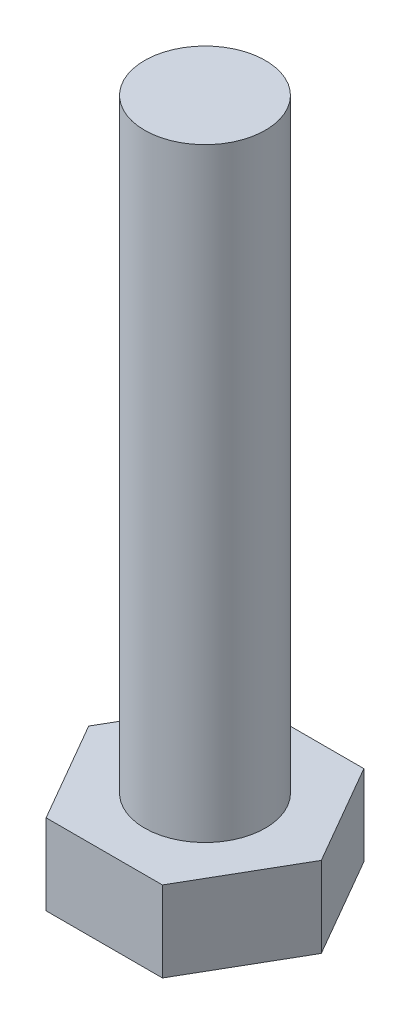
ISO-10303-21;
HEADER;
FILE_DESCRIPTION(('STEP AP214'),'2;1');
FILE_NAME('part.step','',(''),(''),'','','');
FILE_SCHEMA(('AUTOMOTIVE_DESIGN { 1 0 10303 214 1 1 1 1 }'));
ENDSEC;
DATA;
#1=APPLICATION_CONTEXT('core data for automotive mechanical design processes');
#2=APPLICATION_PROTOCOL_DEFINITION('international standard','automotive_design',2000,#1);
#3=PRODUCT_CONTEXT('',#1,'mechanical');
#4=PRODUCT('Part','Part','',(#3));
#5=PRODUCT_RELATED_PRODUCT_CATEGORY('part','',(#4));
#6=PRODUCT_DEFINITION_FORMATION('','',#4);
#7=PRODUCT_DEFINITION_CONTEXT('part definition',#1,'design');
#8=PRODUCT_DEFINITION('design','',#6,#7);
#9=PRODUCT_DEFINITION_SHAPE('','',#8);
#10=(LENGTH_UNIT() NAMED_UNIT(*) SI_UNIT(.MILLI.,.METRE.));
#11=(NAMED_UNIT(*) PLANE_ANGLE_UNIT() SI_UNIT($,.RADIAN.));
#12=(NAMED_UNIT(*) SI_UNIT($,.STERADIAN.) SOLID_ANGLE_UNIT());
#13=UNCERTAINTY_MEASURE_WITH_UNIT(LENGTH_MEASURE(1.E-05),#10,'distance_accuracy_value','');
#14=(GEOMETRIC_REPRESENTATION_CONTEXT(3) GLOBAL_UNCERTAINTY_ASSIGNED_CONTEXT((#13)) GLOBAL_UNIT_ASSIGNED_CONTEXT((#10,
#11,#12)) REPRESENTATION_CONTEXT('',''));
#15=CARTESIAN_POINT('',(0.,0.,0.));
#16=DIRECTION('',(0.,0.,1.));
#17=DIRECTION('',(1.,0.,0.));
#18=AXIS2_PLACEMENT_3D('',#15,#16,#17);
#19=CARTESIAN_POINT('',(5.77350269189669,4.,-1.11022302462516E-13));
#20=DIRECTION('',(0.,1.,0.));
#21=DIRECTION('',(0.,0.,1.));
#22=AXIS2_PLACEMENT_3D('',#19,#20,#21);
#23=PLANE('',#22);
#24=DIRECTION('',(0.5,0.,-0.866025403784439));
#25=VECTOR('',#24,1.);
#26=CARTESIAN_POINT('',(2.88675134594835,4.,5.00000000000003));
#27=LINE('',#26,#25);
#28=CARTESIAN_POINT('',(2.88675134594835,4.,5.00000000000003));
#29=VERTEX_POINT('',#28);
#30=CARTESIAN_POINT('',(5.77350269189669,4.,-1.11022302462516E-13));
#31=VERTEX_POINT('',#30);
#32=EDGE_CURVE('E134',#29,#31,#27,.T.);
#33=ORIENTED_EDGE('',*,*,#32,.T.);
#34=DIRECTION('',(-0.500000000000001,0.,-0.866025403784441));
#35=VECTOR('',#34,1.);
#36=CARTESIAN_POINT('',(5.77350269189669,4.,-1.11022302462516E-13));
#37=LINE('',#36,#35);
#38=CARTESIAN_POINT('',(2.88675134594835,4.,-5.));
#39=VERTEX_POINT('',#38);
#40=EDGE_CURVE('E108',#31,#39,#37,.T.);
#41=ORIENTED_EDGE('',*,*,#40,.T.);
#42=DIRECTION('',(-1.,0.,0.));
#43=VECTOR('',#42,1.);
#44=CARTESIAN_POINT('',(2.88675134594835,4.,-5.));
#45=LINE('',#44,#43);
#46=CARTESIAN_POINT('',(-2.8867513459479,4.,-5.00000000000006));
#47=VERTEX_POINT('',#46);
#48=EDGE_CURVE('E139',#39,#47,#45,.T.);
#49=ORIENTED_EDGE('',*,*,#48,.T.);
#50=DIRECTION('',(-0.5,0.,0.866025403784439));
#51=VECTOR('',#50,1.);
#52=CARTESIAN_POINT('',(-2.8867513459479,4.,-5.00000000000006));
#53=LINE('',#52,#51);
#54=CARTESIAN_POINT('',(-5.77350269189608,4.,0.));
#55=VERTEX_POINT('',#54);
#56=EDGE_CURVE('E142',#47,#55,#53,.T.);
#57=ORIENTED_EDGE('',*,*,#56,.T.);
#58=DIRECTION('',(0.500000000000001,0.,0.866025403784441));
#59=VECTOR('',#58,1.);
#60=CARTESIAN_POINT('',(-5.77350269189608,4.,0.));
#61=LINE('',#60,#59);
#62=CARTESIAN_POINT('',(-2.88675134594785,4.,4.99999999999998));
#63=VERTEX_POINT('',#62);
#64=EDGE_CURVE('E61',#55,#63,#61,.T.);
#65=ORIENTED_EDGE('',*,*,#64,.T.);
#66=DIRECTION('',(1.,0.,0.));
#67=VECTOR('',#66,1.);
#68=CARTESIAN_POINT('',(-2.88675134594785,4.,4.99999999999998));
#69=LINE('',#68,#67);
#70=EDGE_CURVE('E56',#63,#29,#69,.T.);
#71=ORIENTED_EDGE('',*,*,#70,.T.);
#72=EDGE_LOOP('',(#33,#41,#49,#57,#65,#71));
#73=FACE_BOUND('',#72,.T.);
#74=CARTESIAN_POINT('',(1.66533453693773E-13,4.,0.));
#75=DIRECTION('',(0.,1.,0.));
#76=DIRECTION('',(0.,0.,1.));
#77=AXIS2_PLACEMENT_3D('',#74,#75,#76);
#78=CIRCLE('',#77,3.);
#79=CARTESIAN_POINT('',(1.66533453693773E-13,4.,2.99999999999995));
#80=VERTEX_POINT('',#79);
#81=EDGE_CURVE('E120',#80,#80,#78,.T.);
#82=ORIENTED_EDGE('',*,*,#81,.F.);
#83=EDGE_LOOP('',(#82));
#84=FACE_BOUND('',#83,.T.);
#85=ADVANCED_FACE('F40',(#73,#84),#23,.T.);
#86=CARTESIAN_POINT('',(2.88675134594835,4.,5.00000000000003));
#87=DIRECTION('',(-0.866025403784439,0.,-0.5));
#88=DIRECTION('',(-0.5,0.,0.866025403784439));
#89=AXIS2_PLACEMENT_3D('',#86,#87,#88);
#90=PLANE('',#89);
#91=DIRECTION('',(0.5,0.,-0.866025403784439));
#92=VECTOR('',#91,1.);
#93=CARTESIAN_POINT('',(2.88675134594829,0.,5.00000000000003));
#94=LINE('',#93,#92);
#95=CARTESIAN_POINT('',(2.88675134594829,0.,5.00000000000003));
#96=VERTEX_POINT('',#95);
#97=CARTESIAN_POINT('',(5.77350269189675,0.,0.));
#98=VERTEX_POINT('',#97);
#99=EDGE_CURVE('E98',#96,#98,#94,.T.);
#100=ORIENTED_EDGE('',*,*,#99,.T.);
#101=DIRECTION('',(0.,-1.,0.));
#102=VECTOR('',#101,1.);
#103=CARTESIAN_POINT('',(5.77350269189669,4.,-1.11022302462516E-13));
#104=LINE('',#103,#102);
#105=EDGE_CURVE('E11',#31,#98,#104,.T.);
#106=ORIENTED_EDGE('',*,*,#105,.F.);
#107=ORIENTED_EDGE('',*,*,#32,.F.);
#108=DIRECTION('',(0.,-1.,0.));
#109=VECTOR('',#108,1.);
#110=CARTESIAN_POINT('',(2.88675134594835,4.,5.00000000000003));
#111=LINE('',#110,#109);
#112=EDGE_CURVE('E112',#29,#96,#111,.T.);
#113=ORIENTED_EDGE('',*,*,#112,.T.);
#114=EDGE_LOOP('',(#100,#106,#107,#113));
#115=FACE_BOUND('',#114,.T.);
#116=ADVANCED_FACE('F42',(#115),#90,.F.);
#117=CARTESIAN_POINT('',(5.77350269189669,4.,-1.11022302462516E-13));
#118=DIRECTION('',(-0.866025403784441,0.,0.500000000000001));
#119=DIRECTION('',(0.500000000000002,0.,0.866025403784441));
#120=AXIS2_PLACEMENT_3D('',#117,#118,#119);
#121=PLANE('',#120);
#122=DIRECTION('',(-0.500000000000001,0.,-0.866025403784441));
#123=VECTOR('',#122,1.);
#124=CARTESIAN_POINT('',(5.77350269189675,0.,0.));
#125=LINE('',#124,#123);
#126=CARTESIAN_POINT('',(2.88675134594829,0.,-5.));
#127=VERTEX_POINT('',#126);
#128=EDGE_CURVE('E94',#98,#127,#125,.T.);
#129=ORIENTED_EDGE('',*,*,#128,.T.);
#130=DIRECTION('',(0.,-1.,0.));
#131=VECTOR('',#130,1.);
#132=CARTESIAN_POINT('',(2.88675134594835,4.,-5.));
#133=LINE('',#132,#131);
#134=EDGE_CURVE('E49',#39,#127,#133,.T.);
#135=ORIENTED_EDGE('',*,*,#134,.F.);
#136=ORIENTED_EDGE('',*,*,#40,.F.);
#137=ORIENTED_EDGE('',*,*,#105,.T.);
#138=EDGE_LOOP('',(#129,#135,#136,#137));
#139=FACE_BOUND('',#138,.T.);
#140=ADVANCED_FACE('F107',(#139),#121,.F.);
#141=CARTESIAN_POINT('',(2.88675134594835,4.,-5.));
#142=DIRECTION('',(0.,0.,1.));
#143=DIRECTION('',(1.,0.,0.));
#144=AXIS2_PLACEMENT_3D('',#141,#142,#143);
#145=PLANE('',#144);
#146=DIRECTION('',(-1.,0.,0.));
#147=VECTOR('',#146,1.);
#148=CARTESIAN_POINT('',(2.88675134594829,0.,-5.));
#149=LINE('',#148,#147);
#150=CARTESIAN_POINT('',(-2.8867513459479,0.,-5.00000000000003));
#151=VERTEX_POINT('',#150);
#152=EDGE_CURVE('E100',#127,#151,#149,.T.);
#153=ORIENTED_EDGE('',*,*,#152,.T.);
#154=DIRECTION('',(0.,-1.,0.));
#155=VECTOR('',#154,1.);
#156=CARTESIAN_POINT('',(-2.8867513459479,4.,-5.00000000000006));
#157=LINE('',#156,#155);
#158=EDGE_CURVE('E159',#47,#151,#157,.T.);
#159=ORIENTED_EDGE('',*,*,#158,.F.);
#160=ORIENTED_EDGE('',*,*,#48,.F.);
#161=ORIENTED_EDGE('',*,*,#134,.T.);
#162=EDGE_LOOP('',(#153,#159,#160,#161));
#163=FACE_BOUND('',#162,.T.);
#164=ADVANCED_FACE('F164',(#163),#145,.F.);
#165=CARTESIAN_POINT('',(-2.8867513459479,4.,-5.00000000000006));
#166=DIRECTION('',(0.86602540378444,0.,0.500000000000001));
#167=DIRECTION('',(0.500000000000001,0.,-0.86602540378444));
#168=AXIS2_PLACEMENT_3D('',#165,#166,#167);
#169=PLANE('',#168);
#170=DIRECTION('',(-0.5,0.,0.866025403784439));
#171=VECTOR('',#170,1.);
#172=CARTESIAN_POINT('',(-2.8867513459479,0.,-5.00000000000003));
#173=LINE('',#172,#171);
#174=CARTESIAN_POINT('',(-5.77350269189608,0.,0.));
#175=VERTEX_POINT('',#174);
#176=EDGE_CURVE('E126',#151,#175,#173,.T.);
#177=ORIENTED_EDGE('',*,*,#176,.T.);
#178=DIRECTION('',(0.,-1.,0.));
#179=VECTOR('',#178,1.);
#180=CARTESIAN_POINT('',(-5.77350269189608,4.,0.));
#181=LINE('',#180,#179);
#182=EDGE_CURVE('E155',#55,#175,#181,.T.);
#183=ORIENTED_EDGE('',*,*,#182,.F.);
#184=ORIENTED_EDGE('',*,*,#56,.F.);
#185=ORIENTED_EDGE('',*,*,#158,.T.);
#186=EDGE_LOOP('',(#177,#183,#184,#185));
#187=FACE_BOUND('',#186,.T.);
#188=ADVANCED_FACE('F170',(#187),#169,.F.);
#189=CARTESIAN_POINT('',(-5.77350269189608,4.,0.));
#190=DIRECTION('',(0.866025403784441,0.,-0.500000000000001));
#191=DIRECTION('',(-0.500000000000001,0.,-0.866025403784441));
#192=AXIS2_PLACEMENT_3D('',#189,#190,#191);
#193=PLANE('',#192);
#194=DIRECTION('',(0.500000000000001,0.,0.866025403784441));
#195=VECTOR('',#194,1.);
#196=CARTESIAN_POINT('',(-5.77350269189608,0.,0.));
#197=LINE('',#196,#195);
#198=CARTESIAN_POINT('',(-2.88675134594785,0.,4.99999999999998));
#199=VERTEX_POINT('',#198);
#200=EDGE_CURVE('E129',#175,#199,#197,.T.);
#201=ORIENTED_EDGE('',*,*,#200,.T.);
#202=DIRECTION('',(0.,-1.,0.));
#203=VECTOR('',#202,1.);
#204=CARTESIAN_POINT('',(-2.88675134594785,4.,4.99999999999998));
#205=LINE('',#204,#203);
#206=EDGE_CURVE('E151',#63,#199,#205,.T.);
#207=ORIENTED_EDGE('',*,*,#206,.F.);
#208=ORIENTED_EDGE('',*,*,#64,.F.);
#209=ORIENTED_EDGE('',*,*,#182,.T.);
#210=EDGE_LOOP('',(#201,#207,#208,#209));
#211=FACE_BOUND('',#210,.T.);
#212=ADVANCED_FACE('F173',(#211),#193,.F.);
#213=CARTESIAN_POINT('',(-2.88675134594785,4.,4.99999999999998));
#214=DIRECTION('',(0.,0.,-1.));
#215=DIRECTION('',(-1.,0.,0.));
#216=AXIS2_PLACEMENT_3D('',#213,#214,#215);
#217=PLANE('',#216);
#218=DIRECTION('',(1.,0.,0.));
#219=VECTOR('',#218,1.);
#220=CARTESIAN_POINT('',(-2.88675134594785,0.,4.99999999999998));
#221=LINE('',#220,#219);
#222=EDGE_CURVE('E131',#199,#96,#221,.T.);
#223=ORIENTED_EDGE('',*,*,#222,.T.);
#224=ORIENTED_EDGE('',*,*,#112,.F.);
#225=ORIENTED_EDGE('',*,*,#70,.F.);
#226=ORIENTED_EDGE('',*,*,#206,.T.);
#227=EDGE_LOOP('',(#223,#224,#225,#226));
#228=FACE_BOUND('',#227,.T.);
#229=ADVANCED_FACE('F175',(#228),#217,.F.);
#230=CARTESIAN_POINT('',(5.77350269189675,0.,0.));
#231=DIRECTION('',(0.,1.,0.));
#232=DIRECTION('',(0.,0.,1.));
#233=AXIS2_PLACEMENT_3D('',#230,#231,#232);
#234=PLANE('',#233);
#235=ORIENTED_EDGE('',*,*,#99,.F.);
#236=ORIENTED_EDGE('',*,*,#222,.F.);
#237=ORIENTED_EDGE('',*,*,#200,.F.);
#238=ORIENTED_EDGE('',*,*,#176,.F.);
#239=ORIENTED_EDGE('',*,*,#152,.F.);
#240=ORIENTED_EDGE('',*,*,#128,.F.);
#241=EDGE_LOOP('',(#235,#236,#237,#238,#239,#240));
#242=FACE_BOUND('',#241,.T.);
#243=ADVANCED_FACE('F95',(#242),#234,.F.);
#244=CARTESIAN_POINT('',(3.33066907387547E-13,34.,0.));
#245=DIRECTION('',(0.,-1.,0.));
#246=DIRECTION('',(0.,0.,-1.));
#247=AXIS2_PLACEMENT_3D('',#244,#245,#246);
#248=CYLINDRICAL_SURFACE('',#247,3.);
#249=CARTESIAN_POINT('',(3.33066907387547E-13,34.,0.));
#250=DIRECTION('',(0.,1.,0.));
#251=DIRECTION('',(0.,0.,1.));
#252=AXIS2_PLACEMENT_3D('',#249,#250,#251);
#253=CIRCLE('',#252,3.);
#254=CARTESIAN_POINT('',(3.33066907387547E-13,34.,3.00000000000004));
#255=VERTEX_POINT('',#254);
#256=EDGE_CURVE('E114',#255,#255,#253,.T.);
#257=ORIENTED_EDGE('',*,*,#256,.F.);
#258=EDGE_LOOP('',(#257));
#259=FACE_BOUND('',#258,.T.);
#260=ORIENTED_EDGE('',*,*,#81,.T.);
#261=EDGE_LOOP('',(#260));
#262=FACE_BOUND('',#261,.T.);
#263=ADVANCED_FACE('F182',(#259,#262),#248,.T.);
#264=CARTESIAN_POINT('',(3.33066907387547E-13,34.,0.));
#265=DIRECTION('',(0.,1.,0.));
#266=DIRECTION('',(0.,0.,1.));
#267=AXIS2_PLACEMENT_3D('',#264,#265,#266);
#268=PLANE('',#267);
#269=ORIENTED_EDGE('',*,*,#256,.T.);
#270=EDGE_LOOP('',(#269));
#271=FACE_BOUND('',#270,.T.);
#272=ADVANCED_FACE('F193',(#271),#268,.T.);
#273=CLOSED_SHELL('',(#85,#116,#140,#164,#188,#212,#229,#243,#263,#272));
#274=MANIFOLD_SOLID_BREP('B2',#273);
#275=ADVANCED_BREP_SHAPE_REPRESENTATION('',(#18,#274),#14);
#276=SHAPE_DEFINITION_REPRESENTATION(#9,#275);
ENDSEC;
END-ISO-10303-21;
